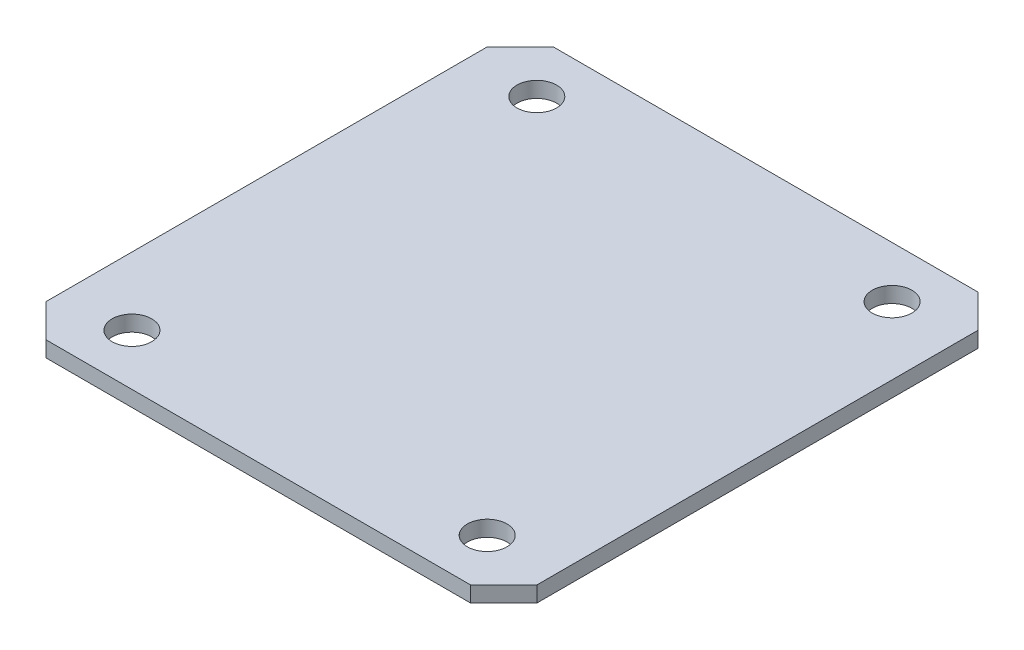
ISO-10303-21;
HEADER;
FILE_DESCRIPTION(('STEP AP214'),'2;1');
FILE_NAME('part.step','',(''),(''),'','','');
FILE_SCHEMA(('AUTOMOTIVE_DESIGN { 1 0 10303 214 1 1 1 1 }'));
ENDSEC;
DATA;
#1=APPLICATION_CONTEXT('core data for automotive mechanical design processes');
#2=APPLICATION_PROTOCOL_DEFINITION('international standard','automotive_design',2000,#1);
#3=PRODUCT_CONTEXT('',#1,'mechanical');
#4=PRODUCT('Part','Part','',(#3));
#5=PRODUCT_RELATED_PRODUCT_CATEGORY('part','',(#4));
#6=PRODUCT_DEFINITION_FORMATION('','',#4);
#7=PRODUCT_DEFINITION_CONTEXT('part definition',#1,'design');
#8=PRODUCT_DEFINITION('design','',#6,#7);
#9=PRODUCT_DEFINITION_SHAPE('','',#8);
#10=(LENGTH_UNIT() NAMED_UNIT(*) SI_UNIT(.MILLI.,.METRE.));
#11=(NAMED_UNIT(*) PLANE_ANGLE_UNIT() SI_UNIT($,.RADIAN.));
#12=(NAMED_UNIT(*) SI_UNIT($,.STERADIAN.) SOLID_ANGLE_UNIT());
#13=UNCERTAINTY_MEASURE_WITH_UNIT(LENGTH_MEASURE(1.E-05),#10,'distance_accuracy_value','');
#14=(GEOMETRIC_REPRESENTATION_CONTEXT(3) GLOBAL_UNCERTAINTY_ASSIGNED_CONTEXT((#13)) GLOBAL_UNIT_ASSIGNED_CONTEXT((#10,
#11,#12)) REPRESENTATION_CONTEXT('',''));
#15=CARTESIAN_POINT('',(0.,0.,0.));
#16=DIRECTION('',(0.,0.,1.));
#17=DIRECTION('',(1.,0.,0.));
#18=AXIS2_PLACEMENT_3D('',#15,#16,#17);
#19=CARTESIAN_POINT('',(-14.85,0.95,15.35));
#20=DIRECTION('',(1.,0.,0.));
#21=DIRECTION('',(0.,0.,-1.));
#22=AXIS2_PLACEMENT_3D('',#19,#20,#21);
#23=PLANE('',#22);
#24=DIRECTION('',(0.,0.,1.));
#25=VECTOR('',#24,1.);
#26=CARTESIAN_POINT('',(-14.85,0.95,15.35));
#27=LINE('',#26,#25);
#28=CARTESIAN_POINT('',(-14.85,0.95,-13.35));
#29=VERTEX_POINT('',#28);
#30=CARTESIAN_POINT('',(-14.85,0.95,13.35));
#31=VERTEX_POINT('',#30);
#32=EDGE_CURVE('E118',#29,#31,#27,.T.);
#33=ORIENTED_EDGE('',*,*,#32,.F.);
#34=DIRECTION('',(0.,-1.,0.));
#35=VECTOR('',#34,1.);
#36=CARTESIAN_POINT('',(-14.85,0.95,-13.35));
#37=LINE('',#36,#35);
#38=CARTESIAN_POINT('',(-14.85,0.,-13.35));
#39=VERTEX_POINT('',#38);
#40=EDGE_CURVE('E103',#29,#39,#37,.T.);
#41=ORIENTED_EDGE('',*,*,#40,.T.);
#42=DIRECTION('',(0.,0.,1.));
#43=VECTOR('',#42,1.);
#44=CARTESIAN_POINT('',(-14.85,0.,15.35));
#45=LINE('',#44,#43);
#46=CARTESIAN_POINT('',(-14.85,0.,13.35));
#47=VERTEX_POINT('',#46);
#48=EDGE_CURVE('E115',#39,#47,#45,.T.);
#49=ORIENTED_EDGE('',*,*,#48,.T.);
#50=DIRECTION('',(0.,1.,0.));
#51=VECTOR('',#50,1.);
#52=CARTESIAN_POINT('',(-14.85,0.95,13.35));
#53=LINE('',#52,#51);
#54=EDGE_CURVE('E120',#47,#31,#53,.T.);
#55=ORIENTED_EDGE('',*,*,#54,.T.);
#56=EDGE_LOOP('',(#33,#41,#49,#55));
#57=FACE_BOUND('',#56,.T.);
#58=ADVANCED_FACE('F33',(#57),#23,.F.);
#59=CARTESIAN_POINT('',(14.85,0.95,15.35));
#60=DIRECTION('',(0.,0.,-1.));
#61=DIRECTION('',(-1.,0.,0.));
#62=AXIS2_PLACEMENT_3D('',#59,#60,#61);
#63=PLANE('',#62);
#64=DIRECTION('',(1.,0.,0.));
#65=VECTOR('',#64,1.);
#66=CARTESIAN_POINT('',(14.85,0.,15.35));
#67=LINE('',#66,#65);
#68=CARTESIAN_POINT('',(-12.85,0.,15.35));
#69=VERTEX_POINT('',#68);
#70=CARTESIAN_POINT('',(12.85,0.,15.35));
#71=VERTEX_POINT('',#70);
#72=EDGE_CURVE('E125',#69,#71,#67,.T.);
#73=ORIENTED_EDGE('',*,*,#72,.T.);
#74=DIRECTION('',(0.,1.,0.));
#75=VECTOR('',#74,1.);
#76=CARTESIAN_POINT('',(12.85,0.95,15.35));
#77=LINE('',#76,#75);
#78=CARTESIAN_POINT('',(12.85,0.95,15.35));
#79=VERTEX_POINT('',#78);
#80=EDGE_CURVE('E11',#71,#79,#77,.T.);
#81=ORIENTED_EDGE('',*,*,#80,.T.);
#82=DIRECTION('',(1.,0.,0.));
#83=VECTOR('',#82,1.);
#84=CARTESIAN_POINT('',(14.85,0.95,15.35));
#85=LINE('',#84,#83);
#86=CARTESIAN_POINT('',(-12.85,0.95,15.35));
#87=VERTEX_POINT('',#86);
#88=EDGE_CURVE('E177',#87,#79,#85,.T.);
#89=ORIENTED_EDGE('',*,*,#88,.F.);
#90=DIRECTION('',(0.,-1.,0.));
#91=VECTOR('',#90,1.);
#92=CARTESIAN_POINT('',(-12.85,0.95,15.35));
#93=LINE('',#92,#91);
#94=EDGE_CURVE('E41',#87,#69,#93,.T.);
#95=ORIENTED_EDGE('',*,*,#94,.T.);
#96=EDGE_LOOP('',(#73,#81,#89,#95));
#97=FACE_BOUND('',#96,.T.);
#98=ADVANCED_FACE('F175',(#97),#63,.F.);
#99=CARTESIAN_POINT('',(14.85,0.95,15.35));
#100=DIRECTION('',(-1.,0.,0.));
#101=DIRECTION('',(0.,0.,1.));
#102=AXIS2_PLACEMENT_3D('',#99,#100,#101);
#103=PLANE('',#102);
#104=DIRECTION('',(0.,0.,-1.));
#105=VECTOR('',#104,1.);
#106=CARTESIAN_POINT('',(14.85,0.,15.35));
#107=LINE('',#106,#105);
#108=CARTESIAN_POINT('',(14.85,0.,13.35));
#109=VERTEX_POINT('',#108);
#110=CARTESIAN_POINT('',(14.85,0.,-13.35));
#111=VERTEX_POINT('',#110);
#112=EDGE_CURVE('E129',#109,#111,#107,.T.);
#113=ORIENTED_EDGE('',*,*,#112,.T.);
#114=DIRECTION('',(0.,1.,0.));
#115=VECTOR('',#114,1.);
#116=CARTESIAN_POINT('',(14.85,0.95,-13.35));
#117=LINE('',#116,#115);
#118=CARTESIAN_POINT('',(14.85,0.95,-13.35));
#119=VERTEX_POINT('',#118);
#120=EDGE_CURVE('E48',#111,#119,#117,.T.);
#121=ORIENTED_EDGE('',*,*,#120,.T.);
#122=DIRECTION('',(0.,0.,-1.));
#123=VECTOR('',#122,1.);
#124=CARTESIAN_POINT('',(14.85,0.95,15.35));
#125=LINE('',#124,#123);
#126=CARTESIAN_POINT('',(14.85,0.95,13.35));
#127=VERTEX_POINT('',#126);
#128=EDGE_CURVE('E185',#127,#119,#125,.T.);
#129=ORIENTED_EDGE('',*,*,#128,.F.);
#130=DIRECTION('',(0.,-1.,0.));
#131=VECTOR('',#130,1.);
#132=CARTESIAN_POINT('',(14.85,0.95,13.35));
#133=LINE('',#132,#131);
#134=EDGE_CURVE('E168',#127,#109,#133,.T.);
#135=ORIENTED_EDGE('',*,*,#134,.T.);
#136=EDGE_LOOP('',(#113,#121,#129,#135));
#137=FACE_BOUND('',#136,.T.);
#138=ADVANCED_FACE('F184',(#137),#103,.F.);
#139=CARTESIAN_POINT('',(14.85,0.95,-15.35));
#140=DIRECTION('',(0.,0.,1.));
#141=DIRECTION('',(1.,0.,0.));
#142=AXIS2_PLACEMENT_3D('',#139,#140,#141);
#143=PLANE('',#142);
#144=DIRECTION('',(-1.,0.,0.));
#145=VECTOR('',#144,1.);
#146=CARTESIAN_POINT('',(14.85,0.,-15.35));
#147=LINE('',#146,#145);
#148=CARTESIAN_POINT('',(12.85,0.,-15.35));
#149=VERTEX_POINT('',#148);
#150=CARTESIAN_POINT('',(-12.85,0.,-15.35));
#151=VERTEX_POINT('',#150);
#152=EDGE_CURVE('E139',#149,#151,#147,.T.);
#153=ORIENTED_EDGE('',*,*,#152,.T.);
#154=DIRECTION('',(0.,1.,0.));
#155=VECTOR('',#154,1.);
#156=CARTESIAN_POINT('',(-12.85,0.95,-15.35));
#157=LINE('',#156,#155);
#158=CARTESIAN_POINT('',(-12.85,0.95,-15.35));
#159=VERTEX_POINT('',#158);
#160=EDGE_CURVE('E104',#151,#159,#157,.T.);
#161=ORIENTED_EDGE('',*,*,#160,.T.);
#162=DIRECTION('',(-1.,0.,0.));
#163=VECTOR('',#162,1.);
#164=CARTESIAN_POINT('',(14.85,0.95,-15.35));
#165=LINE('',#164,#163);
#166=CARTESIAN_POINT('',(12.85,0.95,-15.35));
#167=VERTEX_POINT('',#166);
#168=EDGE_CURVE('E135',#167,#159,#165,.T.);
#169=ORIENTED_EDGE('',*,*,#168,.F.);
#170=DIRECTION('',(0.,-1.,0.));
#171=VECTOR('',#170,1.);
#172=CARTESIAN_POINT('',(12.85,0.95,-15.35));
#173=LINE('',#172,#171);
#174=EDGE_CURVE('E109',#167,#149,#173,.T.);
#175=ORIENTED_EDGE('',*,*,#174,.T.);
#176=EDGE_LOOP('',(#153,#161,#169,#175));
#177=FACE_BOUND('',#176,.T.);
#178=ADVANCED_FACE('F213',(#177),#143,.F.);
#179=CARTESIAN_POINT('',(-14.85,0.95,-15.35));
#180=DIRECTION('',(0.,1.,0.));
#181=DIRECTION('',(0.,0.,1.));
#182=AXIS2_PLACEMENT_3D('',#179,#180,#181);
#183=PLANE('',#182);
#184=CARTESIAN_POINT('',(10.75,0.95,12.25));
#185=DIRECTION('',(0.,1.,0.));
#186=DIRECTION('',(0.,0.,1.));
#187=AXIS2_PLACEMENT_3D('',#184,#185,#186);
#188=CIRCLE('',#187,1.2);
#189=CARTESIAN_POINT('',(10.75,0.95,13.45));
#190=VERTEX_POINT('',#189);
#191=EDGE_CURVE('E193',#190,#190,#188,.T.);
#192=ORIENTED_EDGE('',*,*,#191,.F.);
#193=EDGE_LOOP('',(#192));
#194=FACE_BOUND('',#193,.T.);
#195=CARTESIAN_POINT('',(-10.75,0.95,12.25));
#196=DIRECTION('',(0.,1.,0.));
#197=DIRECTION('',(0.,0.,1.));
#198=AXIS2_PLACEMENT_3D('',#195,#196,#197);
#199=CIRCLE('',#198,1.2);
#200=CARTESIAN_POINT('',(-10.75,0.95,13.45));
#201=VERTEX_POINT('',#200);
#202=EDGE_CURVE('E132',#201,#201,#199,.T.);
#203=ORIENTED_EDGE('',*,*,#202,.F.);
#204=EDGE_LOOP('',(#203));
#205=FACE_BOUND('',#204,.T.);
#206=ORIENTED_EDGE('',*,*,#168,.T.);
#207=DIRECTION('',(0.707106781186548,0.,-0.707106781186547));
#208=VECTOR('',#207,1.);
#209=CARTESIAN_POINT('',(-13.85,0.95,-14.35));
#210=LINE('',#209,#208);
#211=EDGE_CURVE('E166',#159,#29,#210,.F.);
#212=ORIENTED_EDGE('',*,*,#211,.T.);
#213=ORIENTED_EDGE('',*,*,#32,.T.);
#214=DIRECTION('',(-0.707106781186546,0.,-0.707106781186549));
#215=VECTOR('',#214,1.);
#216=CARTESIAN_POINT('',(-29.2,0.95,-1.00000000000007));
#217=LINE('',#216,#215);
#218=EDGE_CURVE('E161',#31,#87,#217,.F.);
#219=ORIENTED_EDGE('',*,*,#218,.T.);
#220=ORIENTED_EDGE('',*,*,#88,.T.);
#221=DIRECTION('',(-0.707106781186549,0.,0.707106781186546));
#222=VECTOR('',#221,1.);
#223=CARTESIAN_POINT('',(14.35,0.95,13.8500000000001));
#224=LINE('',#223,#222);
#225=EDGE_CURVE('E55',#79,#127,#224,.F.);
#226=ORIENTED_EDGE('',*,*,#225,.T.);
#227=ORIENTED_EDGE('',*,*,#128,.T.);
#228=DIRECTION('',(0.707106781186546,0.,0.707106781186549));
#229=VECTOR('',#228,1.);
#230=CARTESIAN_POINT('',(-0.999999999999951,0.95,-29.2));
#231=LINE('',#230,#229);
#232=EDGE_CURVE('E164',#119,#167,#231,.F.);
#233=ORIENTED_EDGE('',*,*,#232,.T.);
#234=EDGE_LOOP('',(#206,#212,#213,#219,#220,#226,#227,#233));
#235=FACE_BOUND('',#234,.T.);
#236=CARTESIAN_POINT('',(-10.75,0.95,-12.25));
#237=DIRECTION('',(0.,1.,0.));
#238=DIRECTION('',(0.,0.,1.));
#239=AXIS2_PLACEMENT_3D('',#236,#237,#238);
#240=CIRCLE('',#239,1.2);
#241=CARTESIAN_POINT('',(-10.75,0.95,-11.05));
#242=VERTEX_POINT('',#241);
#243=EDGE_CURVE('E144',#242,#242,#240,.T.);
#244=ORIENTED_EDGE('',*,*,#243,.F.);
#245=EDGE_LOOP('',(#244));
#246=FACE_BOUND('',#245,.T.);
#247=CARTESIAN_POINT('',(10.75,0.95,-12.25));
#248=DIRECTION('',(0.,1.,0.));
#249=DIRECTION('',(0.,0.,1.));
#250=AXIS2_PLACEMENT_3D('',#247,#248,#249);
#251=CIRCLE('',#250,1.2);
#252=CARTESIAN_POINT('',(10.75,0.95,-11.05));
#253=VERTEX_POINT('',#252);
#254=EDGE_CURVE('E150',#253,#253,#251,.T.);
#255=ORIENTED_EDGE('',*,*,#254,.F.);
#256=EDGE_LOOP('',(#255));
#257=FACE_BOUND('',#256,.T.);
#258=ADVANCED_FACE('F210',(#194,#205,#235,#246,#257),#183,.T.);
#259=CARTESIAN_POINT('',(-14.85,0.,-15.35));
#260=DIRECTION('',(0.,1.,0.));
#261=DIRECTION('',(0.,0.,1.));
#262=AXIS2_PLACEMENT_3D('',#259,#260,#261);
#263=PLANE('',#262);
#264=CARTESIAN_POINT('',(10.75,0.,12.25));
#265=DIRECTION('',(0.,1.,0.));
#266=DIRECTION('',(0.,0.,1.));
#267=AXIS2_PLACEMENT_3D('',#264,#265,#266);
#268=CIRCLE('',#267,1.2);
#269=CARTESIAN_POINT('',(10.75,0.,13.45));
#270=VERTEX_POINT('',#269);
#271=EDGE_CURVE('E196',#270,#270,#268,.T.);
#272=ORIENTED_EDGE('',*,*,#271,.T.);
#273=EDGE_LOOP('',(#272));
#274=FACE_BOUND('',#273,.T.);
#275=CARTESIAN_POINT('',(-10.75,0.,12.25));
#276=DIRECTION('',(0.,1.,0.));
#277=DIRECTION('',(0.,0.,1.));
#278=AXIS2_PLACEMENT_3D('',#275,#276,#277);
#279=CIRCLE('',#278,1.2);
#280=CARTESIAN_POINT('',(-10.75,0.,13.45));
#281=VERTEX_POINT('',#280);
#282=EDGE_CURVE('E126',#281,#281,#279,.T.);
#283=ORIENTED_EDGE('',*,*,#282,.T.);
#284=EDGE_LOOP('',(#283));
#285=FACE_BOUND('',#284,.T.);
#286=ORIENTED_EDGE('',*,*,#48,.F.);
#287=DIRECTION('',(-0.707106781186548,0.,0.707106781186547));
#288=VECTOR('',#287,1.);
#289=CARTESIAN_POINT('',(-14.85,0.,-13.35));
#290=LINE('',#289,#288);
#291=EDGE_CURVE('E99',#39,#151,#290,.F.);
#292=ORIENTED_EDGE('',*,*,#291,.T.);
#293=ORIENTED_EDGE('',*,*,#152,.F.);
#294=DIRECTION('',(-0.707106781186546,0.,-0.707106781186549));
#295=VECTOR('',#294,1.);
#296=CARTESIAN_POINT('',(12.85,0.,-15.35));
#297=LINE('',#296,#295);
#298=EDGE_CURVE('E110',#149,#111,#297,.F.);
#299=ORIENTED_EDGE('',*,*,#298,.T.);
#300=ORIENTED_EDGE('',*,*,#112,.F.);
#301=DIRECTION('',(0.707106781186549,0.,-0.707106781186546));
#302=VECTOR('',#301,1.);
#303=CARTESIAN_POINT('',(14.85,0.,13.35));
#304=LINE('',#303,#302);
#305=EDGE_CURVE('E155',#109,#71,#304,.F.);
#306=ORIENTED_EDGE('',*,*,#305,.T.);
#307=ORIENTED_EDGE('',*,*,#72,.F.);
#308=DIRECTION('',(0.707106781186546,0.,0.707106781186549));
#309=VECTOR('',#308,1.);
#310=CARTESIAN_POINT('',(-12.85,0.,15.35));
#311=LINE('',#310,#309);
#312=EDGE_CURVE('E119',#69,#47,#311,.F.);
#313=ORIENTED_EDGE('',*,*,#312,.T.);
#314=EDGE_LOOP('',(#286,#292,#293,#299,#300,#306,#307,#313));
#315=FACE_BOUND('',#314,.T.);
#316=CARTESIAN_POINT('',(-10.75,0.,-12.25));
#317=DIRECTION('',(0.,1.,0.));
#318=DIRECTION('',(0.,0.,1.));
#319=AXIS2_PLACEMENT_3D('',#316,#317,#318);
#320=CIRCLE('',#319,1.2);
#321=CARTESIAN_POINT('',(-10.75,0.,-11.05));
#322=VERTEX_POINT('',#321);
#323=EDGE_CURVE('E141',#322,#322,#320,.T.);
#324=ORIENTED_EDGE('',*,*,#323,.T.);
#325=EDGE_LOOP('',(#324));
#326=FACE_BOUND('',#325,.T.);
#327=CARTESIAN_POINT('',(10.75,0.,-12.25));
#328=DIRECTION('',(0.,1.,0.));
#329=DIRECTION('',(0.,0.,1.));
#330=AXIS2_PLACEMENT_3D('',#327,#328,#329);
#331=CIRCLE('',#330,1.2);
#332=CARTESIAN_POINT('',(10.75,0.,-11.05));
#333=VERTEX_POINT('',#332);
#334=EDGE_CURVE('E147',#333,#333,#331,.T.);
#335=ORIENTED_EDGE('',*,*,#334,.T.);
#336=EDGE_LOOP('',(#335));
#337=FACE_BOUND('',#336,.T.);
#338=ADVANCED_FACE('F122',(#274,#285,#315,#326,#337),#263,.F.);
#339=CARTESIAN_POINT('',(-10.75,0.95,12.25));
#340=DIRECTION('',(0.,1.,0.));
#341=DIRECTION('',(0.,0.,1.));
#342=AXIS2_PLACEMENT_3D('',#339,#340,#341);
#343=CYLINDRICAL_SURFACE('',#342,1.2);
#344=ORIENTED_EDGE('',*,*,#282,.F.);
#345=EDGE_LOOP('',(#344));
#346=FACE_BOUND('',#345,.T.);
#347=ORIENTED_EDGE('',*,*,#202,.T.);
#348=EDGE_LOOP('',(#347));
#349=FACE_BOUND('',#348,.T.);
#350=ADVANCED_FACE('F206',(#346,#349),#343,.F.);
#351=CARTESIAN_POINT('',(10.75,0.95,12.25));
#352=DIRECTION('',(0.,1.,0.));
#353=DIRECTION('',(0.,0.,1.));
#354=AXIS2_PLACEMENT_3D('',#351,#352,#353);
#355=CYLINDRICAL_SURFACE('',#354,1.2);
#356=ORIENTED_EDGE('',*,*,#271,.F.);
#357=EDGE_LOOP('',(#356));
#358=FACE_BOUND('',#357,.T.);
#359=ORIENTED_EDGE('',*,*,#191,.T.);
#360=EDGE_LOOP('',(#359));
#361=FACE_BOUND('',#360,.T.);
#362=ADVANCED_FACE('F202',(#358,#361),#355,.F.);
#363=CARTESIAN_POINT('',(-10.75,0.95,-12.25));
#364=DIRECTION('',(0.,1.,0.));
#365=DIRECTION('',(0.,0.,1.));
#366=AXIS2_PLACEMENT_3D('',#363,#364,#365);
#367=CYLINDRICAL_SURFACE('',#366,1.2);
#368=ORIENTED_EDGE('',*,*,#323,.F.);
#369=EDGE_LOOP('',(#368));
#370=FACE_BOUND('',#369,.T.);
#371=ORIENTED_EDGE('',*,*,#243,.T.);
#372=EDGE_LOOP('',(#371));
#373=FACE_BOUND('',#372,.T.);
#374=ADVANCED_FACE('F205',(#370,#373),#367,.F.);
#375=CARTESIAN_POINT('',(10.75,0.95,-12.25));
#376=DIRECTION('',(0.,1.,0.));
#377=DIRECTION('',(0.,0.,1.));
#378=AXIS2_PLACEMENT_3D('',#375,#376,#377);
#379=CYLINDRICAL_SURFACE('',#378,1.2);
#380=ORIENTED_EDGE('',*,*,#334,.F.);
#381=EDGE_LOOP('',(#380));
#382=FACE_BOUND('',#381,.T.);
#383=ORIENTED_EDGE('',*,*,#254,.T.);
#384=EDGE_LOOP('',(#383));
#385=FACE_BOUND('',#384,.T.);
#386=ADVANCED_FACE('F222',(#382,#385),#379,.F.);
#387=CARTESIAN_POINT('',(-14.85,0.95,-13.35));
#388=DIRECTION('',(0.707106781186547,0.,0.707106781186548));
#389=DIRECTION('',(0.707106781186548,0.,-0.707106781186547));
#390=AXIS2_PLACEMENT_3D('',#387,#388,#389);
#391=PLANE('',#390);
#392=ORIENTED_EDGE('',*,*,#211,.F.);
#393=ORIENTED_EDGE('',*,*,#160,.F.);
#394=ORIENTED_EDGE('',*,*,#291,.F.);
#395=ORIENTED_EDGE('',*,*,#40,.F.);
#396=EDGE_LOOP('',(#392,#393,#394,#395));
#397=FACE_BOUND('',#396,.T.);
#398=ADVANCED_FACE('F102',(#397),#391,.F.);
#399=CARTESIAN_POINT('',(12.85,0.95,-15.35));
#400=DIRECTION('',(-0.707106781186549,0.,0.707106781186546));
#401=DIRECTION('',(0.707106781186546,0.,0.707106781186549));
#402=AXIS2_PLACEMENT_3D('',#399,#400,#401);
#403=PLANE('',#402);
#404=ORIENTED_EDGE('',*,*,#232,.F.);
#405=ORIENTED_EDGE('',*,*,#120,.F.);
#406=ORIENTED_EDGE('',*,*,#298,.F.);
#407=ORIENTED_EDGE('',*,*,#174,.F.);
#408=EDGE_LOOP('',(#404,#405,#406,#407));
#409=FACE_BOUND('',#408,.T.);
#410=ADVANCED_FACE('F230',(#409),#403,.F.);
#411=CARTESIAN_POINT('',(14.85,0.95,13.35));
#412=DIRECTION('',(-0.707106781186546,0.,-0.707106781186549));
#413=DIRECTION('',(-0.707106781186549,0.,0.707106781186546));
#414=AXIS2_PLACEMENT_3D('',#411,#412,#413);
#415=PLANE('',#414);
#416=ORIENTED_EDGE('',*,*,#225,.F.);
#417=ORIENTED_EDGE('',*,*,#80,.F.);
#418=ORIENTED_EDGE('',*,*,#305,.F.);
#419=ORIENTED_EDGE('',*,*,#134,.F.);
#420=EDGE_LOOP('',(#416,#417,#418,#419));
#421=FACE_BOUND('',#420,.T.);
#422=ADVANCED_FACE('F183',(#421),#415,.F.);
#423=CARTESIAN_POINT('',(-12.85,0.95,15.35));
#424=DIRECTION('',(0.707106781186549,0.,-0.707106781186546));
#425=DIRECTION('',(-0.707106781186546,0.,-0.707106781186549));
#426=AXIS2_PLACEMENT_3D('',#423,#424,#425);
#427=PLANE('',#426);
#428=ORIENTED_EDGE('',*,*,#218,.F.);
#429=ORIENTED_EDGE('',*,*,#54,.F.);
#430=ORIENTED_EDGE('',*,*,#312,.F.);
#431=ORIENTED_EDGE('',*,*,#94,.F.);
#432=EDGE_LOOP('',(#428,#429,#430,#431));
#433=FACE_BOUND('',#432,.T.);
#434=ADVANCED_FACE('F35',(#433),#427,.F.);
#435=CLOSED_SHELL('',(#58,#98,#138,#178,#258,#338,#350,#362,#374,#386,#398,#410,#422,#434));
#436=MANIFOLD_SOLID_BREP('B2',#435);
#437=ADVANCED_BREP_SHAPE_REPRESENTATION('',(#18,#436),#14);
#438=SHAPE_DEFINITION_REPRESENTATION(#9,#437);
ENDSEC;
END-ISO-10303-21;
